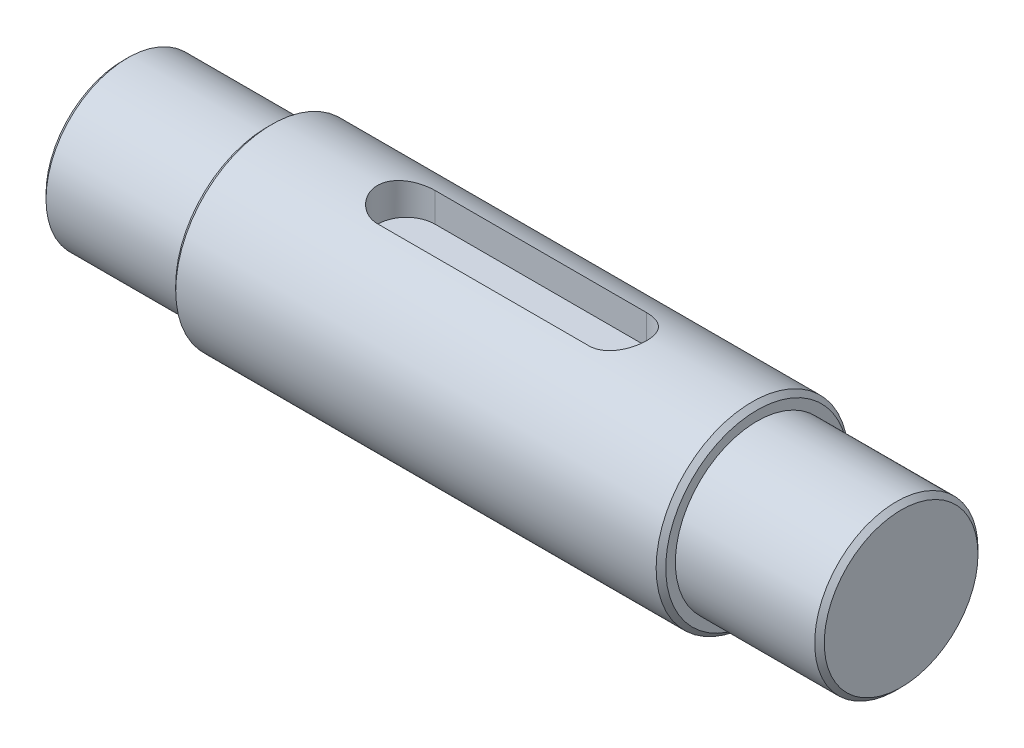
from build123d import *

# Parameters (mm, degrees)
SKETCH1_W           = 51
SKETCH1_H           = 10
SKETCH2_R           = 8.5
BOSS_EXTRUDE1_DEPTH = 15
BOSS_EXTRUDE2_START = 15
SKETCH3_R           = 8.5
BOSS_EXTRUDE2_DEPTH = 15
CHAMFER1_SIZE       = 0.5
CUT_EXTRUDE2_DEPTH  = 10


with BuildPart() as part:
    # Sketch1 → Revolve1 (revolve)
    with BuildSketch(Plane(origin=(0, 0, 0), x_dir=(-1, 0, 0), z_dir=(0, 0, -1)), mode=Mode.PRIVATE) as revolve1_sk:
        with Locations((-40.5, 5)):
            Rectangle(SKETCH1_W, SKETCH1_H)
    revolve(revolve1_sk.sketch.rotate(Axis((66, 0, 0), (-1, 0, 0)), 270), axis=Axis((66, 0, 0), (-1, 0, 0)))

    # Sketch2 → Boss-Extrude1 (add)
    with BuildSketch(Plane.ZY.offset(-15)):
        Circle(SKETCH2_R)
    extrude(amount=BOSS_EXTRUDE1_DEPTH)

    # Sketch3 → Boss-Extrude2 (add)
    with BuildSketch(Plane(origin=(66, 0, 0), x_dir=(0, 0, -1), z_dir=(1, 0, 0)).offset(BOSS_EXTRUDE2_START)):
        with Locations(Location((0, 0, 0), (0, 0, 180))):
            Circle(SKETCH3_R)
    extrude(amount=-BOSS_EXTRUDE2_DEPTH)

    # Chamfer1
    chamfer1_edges = [part.edges().sort_by_distance(p)[0] for p in [
        (0, 0, -8.5),
        (81, 0, -8.5),
        (15, 0, -10),
        (66, 0, -10),
    ]]
    chamfer(chamfer1_edges, length=CHAMFER1_SIZE)

    # Sketch4 → Cut-Extrude2 (cut)
    with BuildSketch(Plane.XZ.offset(-6.5)):
        with BuildLine():
            Line((51.5, 3), (29.5, 3))
            ThreePointArc((29.5, 3), (26.5, 0), (29.5, -3))
            Line((29.5, -3), (51.5, -3))
            ThreePointArc((51.5, -3), (54.5, 0), (51.5, 3))
        make_face()
    extrude(amount=-CUT_EXTRUDE2_DEPTH, mode=Mode.SUBTRACT)


solid = part.part
